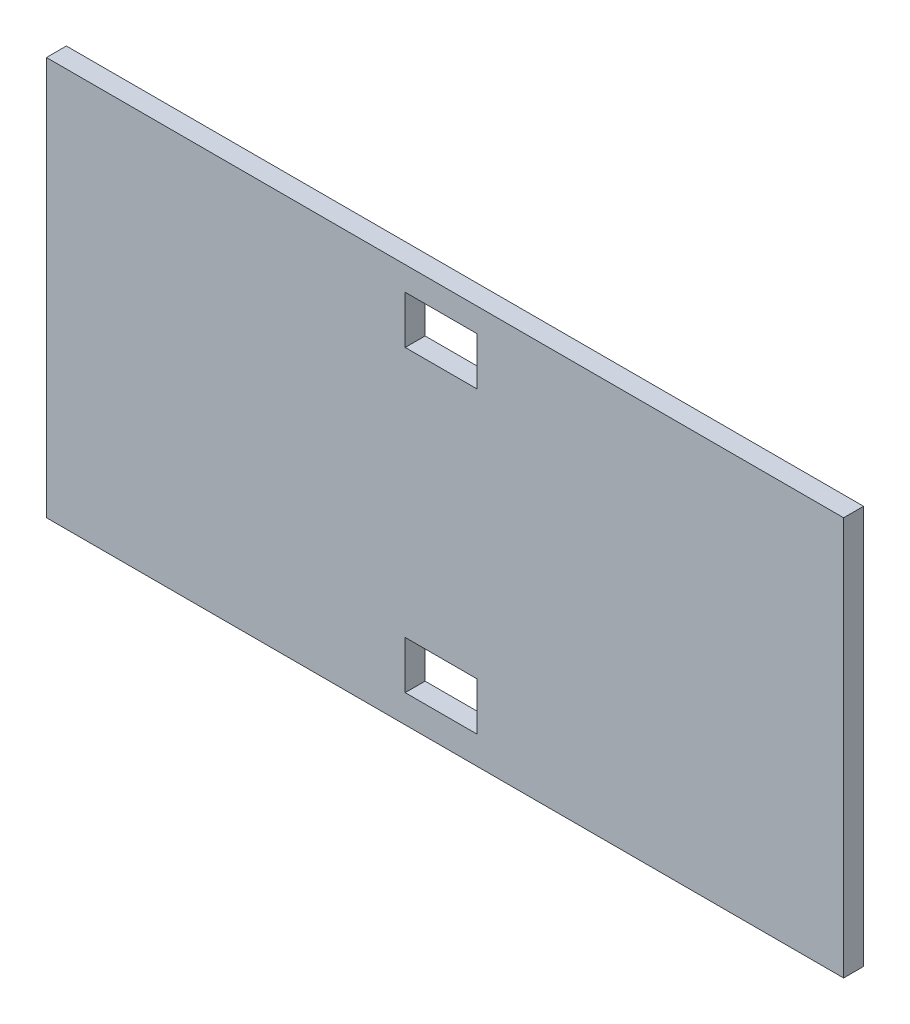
ISO-10303-21;
HEADER;
FILE_DESCRIPTION(('STEP AP214'),'2;1');
FILE_NAME('part.step','',(''),(''),'','','');
FILE_SCHEMA(('AUTOMOTIVE_DESIGN { 1 0 10303 214 1 1 1 1 }'));
ENDSEC;
DATA;
#1=APPLICATION_CONTEXT('core data for automotive mechanical design processes');
#2=APPLICATION_PROTOCOL_DEFINITION('international standard','automotive_design',2000,#1);
#3=PRODUCT_CONTEXT('',#1,'mechanical');
#4=PRODUCT('Part','Part','',(#3));
#5=PRODUCT_RELATED_PRODUCT_CATEGORY('part','',(#4));
#6=PRODUCT_DEFINITION_FORMATION('','',#4);
#7=PRODUCT_DEFINITION_CONTEXT('part definition',#1,'design');
#8=PRODUCT_DEFINITION('design','',#6,#7);
#9=PRODUCT_DEFINITION_SHAPE('','',#8);
#10=(LENGTH_UNIT() NAMED_UNIT(*) SI_UNIT(.MILLI.,.METRE.));
#11=(NAMED_UNIT(*) PLANE_ANGLE_UNIT() SI_UNIT($,.RADIAN.));
#12=(NAMED_UNIT(*) SI_UNIT($,.STERADIAN.) SOLID_ANGLE_UNIT());
#13=UNCERTAINTY_MEASURE_WITH_UNIT(LENGTH_MEASURE(1.E-05),#10,'distance_accuracy_value','');
#14=(GEOMETRIC_REPRESENTATION_CONTEXT(3) GLOBAL_UNCERTAINTY_ASSIGNED_CONTEXT((#13)) GLOBAL_UNIT_ASSIGNED_CONTEXT((#10,
#11,#12)) REPRESENTATION_CONTEXT('',''));
#15=CARTESIAN_POINT('',(0.,0.,0.));
#16=DIRECTION('',(0.,0.,1.));
#17=DIRECTION('',(1.,0.,0.));
#18=AXIS2_PLACEMENT_3D('',#15,#16,#17);
#19=CARTESIAN_POINT('',(0.,0.,6.35));
#20=DIRECTION('',(-1.,0.,0.));
#21=DIRECTION('',(0.,0.,1.));
#22=AXIS2_PLACEMENT_3D('',#19,#20,#21);
#23=PLANE('',#22);
#24=DIRECTION('',(0.,1.,0.));
#25=VECTOR('',#24,1.);
#26=CARTESIAN_POINT('',(0.,0.,0.));
#27=LINE('',#26,#25);
#28=CARTESIAN_POINT('',(0.,0.,0.));
#29=VERTEX_POINT('',#28);
#30=CARTESIAN_POINT('',(0.,127.,0.));
#31=VERTEX_POINT('',#30);
#32=EDGE_CURVE('E212',#29,#31,#27,.T.);
#33=ORIENTED_EDGE('',*,*,#32,.F.);
#34=DIRECTION('',(0.,0.,-1.));
#35=VECTOR('',#34,1.);
#36=CARTESIAN_POINT('',(0.,0.,6.35));
#37=LINE('',#36,#35);
#38=CARTESIAN_POINT('',(0.,0.,6.35));
#39=VERTEX_POINT('',#38);
#40=EDGE_CURVE('E11',#39,#29,#37,.T.);
#41=ORIENTED_EDGE('',*,*,#40,.F.);
#42=DIRECTION('',(0.,1.,0.));
#43=VECTOR('',#42,1.);
#44=CARTESIAN_POINT('',(0.,0.,6.35));
#45=LINE('',#44,#43);
#46=CARTESIAN_POINT('',(0.,127.,6.35));
#47=VERTEX_POINT('',#46);
#48=EDGE_CURVE('E222',#39,#47,#45,.T.);
#49=ORIENTED_EDGE('',*,*,#48,.T.);
#50=DIRECTION('',(0.,0.,-1.));
#51=VECTOR('',#50,1.);
#52=CARTESIAN_POINT('',(0.,127.,6.35));
#53=LINE('',#52,#51);
#54=EDGE_CURVE('E42',#47,#31,#53,.T.);
#55=ORIENTED_EDGE('',*,*,#54,.T.);
#56=EDGE_LOOP('',(#33,#41,#49,#55));
#57=FACE_BOUND('',#56,.T.);
#58=ADVANCED_FACE('F39',(#57),#23,.T.);
#59=CARTESIAN_POINT('',(0.,0.,6.35));
#60=DIRECTION('',(0.,1.,0.));
#61=DIRECTION('',(0.,0.,1.));
#62=AXIS2_PLACEMENT_3D('',#59,#60,#61);
#63=PLANE('',#62);
#64=DIRECTION('',(1.,0.,0.));
#65=VECTOR('',#64,1.);
#66=CARTESIAN_POINT('',(0.,0.,0.));
#67=LINE('',#66,#65);
#68=CARTESIAN_POINT('',(254.,0.,0.));
#69=VERTEX_POINT('',#68);
#70=EDGE_CURVE('E227',#29,#69,#67,.T.);
#71=ORIENTED_EDGE('',*,*,#70,.T.);
#72=DIRECTION('',(0.,0.,-1.));
#73=VECTOR('',#72,1.);
#74=CARTESIAN_POINT('',(254.,0.,6.35));
#75=LINE('',#74,#73);
#76=CARTESIAN_POINT('',(254.,0.,6.35));
#77=VERTEX_POINT('',#76);
#78=EDGE_CURVE('E48',#77,#69,#75,.T.);
#79=ORIENTED_EDGE('',*,*,#78,.F.);
#80=DIRECTION('',(1.,0.,0.));
#81=VECTOR('',#80,1.);
#82=CARTESIAN_POINT('',(0.,0.,6.35));
#83=LINE('',#82,#81);
#84=EDGE_CURVE('E234',#39,#77,#83,.T.);
#85=ORIENTED_EDGE('',*,*,#84,.F.);
#86=ORIENTED_EDGE('',*,*,#40,.T.);
#87=EDGE_LOOP('',(#71,#79,#85,#86));
#88=FACE_BOUND('',#87,.T.);
#89=ADVANCED_FACE('F268',(#88),#63,.F.);
#90=CARTESIAN_POINT('',(254.,0.,6.35));
#91=DIRECTION('',(-1.,0.,0.));
#92=DIRECTION('',(0.,0.,1.));
#93=AXIS2_PLACEMENT_3D('',#90,#91,#92);
#94=PLANE('',#93);
#95=DIRECTION('',(0.,1.,0.));
#96=VECTOR('',#95,1.);
#97=CARTESIAN_POINT('',(254.,0.,0.));
#98=LINE('',#97,#96);
#99=CARTESIAN_POINT('',(254.,127.,0.));
#100=VERTEX_POINT('',#99);
#101=EDGE_CURVE('E244',#69,#100,#98,.T.);
#102=ORIENTED_EDGE('',*,*,#101,.T.);
#103=DIRECTION('',(0.,0.,-1.));
#104=VECTOR('',#103,1.);
#105=CARTESIAN_POINT('',(254.,127.,6.35));
#106=LINE('',#105,#104);
#107=CARTESIAN_POINT('',(254.,127.,6.35));
#108=VERTEX_POINT('',#107);
#109=EDGE_CURVE('E252',#108,#100,#106,.T.);
#110=ORIENTED_EDGE('',*,*,#109,.F.);
#111=DIRECTION('',(0.,1.,0.));
#112=VECTOR('',#111,1.);
#113=CARTESIAN_POINT('',(254.,0.,6.35));
#114=LINE('',#113,#112);
#115=EDGE_CURVE('E231',#77,#108,#114,.T.);
#116=ORIENTED_EDGE('',*,*,#115,.F.);
#117=ORIENTED_EDGE('',*,*,#78,.T.);
#118=EDGE_LOOP('',(#102,#110,#116,#117));
#119=FACE_BOUND('',#118,.T.);
#120=ADVANCED_FACE('F272',(#119),#94,.F.);
#121=CARTESIAN_POINT('',(0.,127.,6.35));
#122=DIRECTION('',(0.,1.,0.));
#123=DIRECTION('',(0.,0.,1.));
#124=AXIS2_PLACEMENT_3D('',#121,#122,#123);
#125=PLANE('',#124);
#126=DIRECTION('',(1.,0.,0.));
#127=VECTOR('',#126,1.);
#128=CARTESIAN_POINT('',(0.,127.,0.));
#129=LINE('',#128,#127);
#130=EDGE_CURVE('E240',#31,#100,#129,.T.);
#131=ORIENTED_EDGE('',*,*,#130,.F.);
#132=ORIENTED_EDGE('',*,*,#54,.F.);
#133=DIRECTION('',(1.,0.,0.));
#134=VECTOR('',#133,1.);
#135=CARTESIAN_POINT('',(0.,127.,6.35));
#136=LINE('',#135,#134);
#137=EDGE_CURVE('E226',#47,#108,#136,.T.);
#138=ORIENTED_EDGE('',*,*,#137,.T.);
#139=ORIENTED_EDGE('',*,*,#109,.T.);
#140=EDGE_LOOP('',(#131,#132,#138,#139));
#141=FACE_BOUND('',#140,.T.);
#142=ADVANCED_FACE('F262',(#141),#125,.T.);
#143=CARTESIAN_POINT('',(0.,0.,6.35));
#144=DIRECTION('',(0.,0.,-1.));
#145=DIRECTION('',(-1.,0.,0.));
#146=AXIS2_PLACEMENT_3D('',#143,#144,#145);
#147=PLANE('',#146);
#148=DIRECTION('',(1.,0.,0.));
#149=VECTOR('',#148,1.);
#150=CARTESIAN_POINT('',(114.3,104.14,6.35));
#151=LINE('',#150,#149);
#152=CARTESIAN_POINT('',(114.3,104.14,6.35));
#153=VERTEX_POINT('',#152);
#154=CARTESIAN_POINT('',(137.16,104.14,6.35));
#155=VERTEX_POINT('',#154);
#156=EDGE_CURVE('E163',#153,#155,#151,.T.);
#157=ORIENTED_EDGE('',*,*,#156,.F.);
#158=DIRECTION('',(0.,-1.,0.));
#159=VECTOR('',#158,1.);
#160=CARTESIAN_POINT('',(114.3,119.38,6.35));
#161=LINE('',#160,#159);
#162=CARTESIAN_POINT('',(114.3,119.38,6.35));
#163=VERTEX_POINT('',#162);
#164=EDGE_CURVE('E56',#163,#153,#161,.T.);
#165=ORIENTED_EDGE('',*,*,#164,.F.);
#166=DIRECTION('',(-1.,0.,0.));
#167=VECTOR('',#166,1.);
#168=CARTESIAN_POINT('',(114.3,119.38,6.35));
#169=LINE('',#168,#167);
#170=CARTESIAN_POINT('',(137.16,119.38,6.35));
#171=VERTEX_POINT('',#170);
#172=EDGE_CURVE('E150',#171,#163,#169,.T.);
#173=ORIENTED_EDGE('',*,*,#172,.F.);
#174=DIRECTION('',(0.,1.,0.));
#175=VECTOR('',#174,1.);
#176=CARTESIAN_POINT('',(137.16,119.38,6.35));
#177=LINE('',#176,#175);
#178=EDGE_CURVE('E154',#155,#171,#177,.T.);
#179=ORIENTED_EDGE('',*,*,#178,.F.);
#180=EDGE_LOOP('',(#157,#165,#173,#179));
#181=FACE_BOUND('',#180,.T.);
#182=DIRECTION('',(1.,0.,0.));
#183=VECTOR('',#182,1.);
#184=CARTESIAN_POINT('',(114.3,8.89,6.35));
#185=LINE('',#184,#183);
#186=CARTESIAN_POINT('',(114.3,8.89,6.35));
#187=VERTEX_POINT('',#186);
#188=CARTESIAN_POINT('',(137.16,8.89,6.35));
#189=VERTEX_POINT('',#188);
#190=EDGE_CURVE('E198',#187,#189,#185,.T.);
#191=ORIENTED_EDGE('',*,*,#190,.F.);
#192=DIRECTION('',(0.,-1.,0.));
#193=VECTOR('',#192,1.);
#194=CARTESIAN_POINT('',(114.3,24.13,6.35));
#195=LINE('',#194,#193);
#196=CARTESIAN_POINT('',(114.3,24.13,6.35));
#197=VERTEX_POINT('',#196);
#198=EDGE_CURVE('E172',#197,#187,#195,.T.);
#199=ORIENTED_EDGE('',*,*,#198,.F.);
#200=DIRECTION('',(-1.,0.,0.));
#201=VECTOR('',#200,1.);
#202=CARTESIAN_POINT('',(114.3,24.13,6.35));
#203=LINE('',#202,#201);
#204=CARTESIAN_POINT('',(137.16,24.13,6.35));
#205=VERTEX_POINT('',#204);
#206=EDGE_CURVE('E183',#205,#197,#203,.T.);
#207=ORIENTED_EDGE('',*,*,#206,.F.);
#208=DIRECTION('',(0.,1.,0.));
#209=VECTOR('',#208,1.);
#210=CARTESIAN_POINT('',(137.16,24.13,6.35));
#211=LINE('',#210,#209);
#212=EDGE_CURVE('E202',#189,#205,#211,.T.);
#213=ORIENTED_EDGE('',*,*,#212,.F.);
#214=EDGE_LOOP('',(#191,#199,#207,#213));
#215=FACE_BOUND('',#214,.T.);
#216=ORIENTED_EDGE('',*,*,#48,.F.);
#217=ORIENTED_EDGE('',*,*,#84,.T.);
#218=ORIENTED_EDGE('',*,*,#115,.T.);
#219=ORIENTED_EDGE('',*,*,#137,.F.);
#220=EDGE_LOOP('',(#216,#217,#218,#219));
#221=FACE_BOUND('',#220,.T.);
#222=ADVANCED_FACE('F274',(#181,#215,#221),#147,.F.);
#223=CARTESIAN_POINT('',(0.,0.,0.));
#224=DIRECTION('',(0.,0.,-1.));
#225=DIRECTION('',(-1.,0.,0.));
#226=AXIS2_PLACEMENT_3D('',#223,#224,#225);
#227=PLANE('',#226);
#228=DIRECTION('',(0.,-1.,0.));
#229=VECTOR('',#228,1.);
#230=CARTESIAN_POINT('',(114.3,119.38,0.));
#231=LINE('',#230,#229);
#232=CARTESIAN_POINT('',(114.3,119.38,0.));
#233=VERTEX_POINT('',#232);
#234=CARTESIAN_POINT('',(114.3,104.14,0.));
#235=VERTEX_POINT('',#234);
#236=EDGE_CURVE('E131',#233,#235,#231,.T.);
#237=ORIENTED_EDGE('',*,*,#236,.T.);
#238=DIRECTION('',(1.,0.,0.));
#239=VECTOR('',#238,1.);
#240=CARTESIAN_POINT('',(114.3,104.14,0.));
#241=LINE('',#240,#239);
#242=CARTESIAN_POINT('',(137.16,104.14,0.));
#243=VERTEX_POINT('',#242);
#244=EDGE_CURVE('E141',#235,#243,#241,.T.);
#245=ORIENTED_EDGE('',*,*,#244,.T.);
#246=DIRECTION('',(0.,1.,0.));
#247=VECTOR('',#246,1.);
#248=CARTESIAN_POINT('',(137.16,119.38,0.));
#249=LINE('',#248,#247);
#250=CARTESIAN_POINT('',(137.16,119.38,0.));
#251=VERTEX_POINT('',#250);
#252=EDGE_CURVE('E64',#243,#251,#249,.T.);
#253=ORIENTED_EDGE('',*,*,#252,.T.);
#254=DIRECTION('',(-1.,0.,0.));
#255=VECTOR('',#254,1.);
#256=CARTESIAN_POINT('',(114.3,119.38,0.));
#257=LINE('',#256,#255);
#258=EDGE_CURVE('E138',#251,#233,#257,.T.);
#259=ORIENTED_EDGE('',*,*,#258,.T.);
#260=EDGE_LOOP('',(#237,#245,#253,#259));
#261=FACE_BOUND('',#260,.T.);
#262=DIRECTION('',(0.,-1.,0.));
#263=VECTOR('',#262,1.);
#264=CARTESIAN_POINT('',(114.3,24.13,0.));
#265=LINE('',#264,#263);
#266=CARTESIAN_POINT('',(114.3,24.13,0.));
#267=VERTEX_POINT('',#266);
#268=CARTESIAN_POINT('',(114.3,8.89,0.));
#269=VERTEX_POINT('',#268);
#270=EDGE_CURVE('E178',#267,#269,#265,.T.);
#271=ORIENTED_EDGE('',*,*,#270,.T.);
#272=DIRECTION('',(1.,0.,0.));
#273=VECTOR('',#272,1.);
#274=CARTESIAN_POINT('',(114.3,8.89,0.));
#275=LINE('',#274,#273);
#276=CARTESIAN_POINT('',(137.16,8.89,0.));
#277=VERTEX_POINT('',#276);
#278=EDGE_CURVE('E182',#269,#277,#275,.T.);
#279=ORIENTED_EDGE('',*,*,#278,.T.);
#280=DIRECTION('',(0.,1.,0.));
#281=VECTOR('',#280,1.);
#282=CARTESIAN_POINT('',(137.16,24.13,0.));
#283=LINE('',#282,#281);
#284=CARTESIAN_POINT('',(137.16,24.13,0.));
#285=VERTEX_POINT('',#284);
#286=EDGE_CURVE('E187',#277,#285,#283,.T.);
#287=ORIENTED_EDGE('',*,*,#286,.T.);
#288=DIRECTION('',(-1.,0.,0.));
#289=VECTOR('',#288,1.);
#290=CARTESIAN_POINT('',(114.3,24.13,0.));
#291=LINE('',#290,#289);
#292=EDGE_CURVE('E191',#285,#267,#291,.T.);
#293=ORIENTED_EDGE('',*,*,#292,.T.);
#294=EDGE_LOOP('',(#271,#279,#287,#293));
#295=FACE_BOUND('',#294,.T.);
#296=ORIENTED_EDGE('',*,*,#32,.T.);
#297=ORIENTED_EDGE('',*,*,#130,.T.);
#298=ORIENTED_EDGE('',*,*,#101,.F.);
#299=ORIENTED_EDGE('',*,*,#70,.F.);
#300=EDGE_LOOP('',(#296,#297,#298,#299));
#301=FACE_BOUND('',#300,.T.);
#302=ADVANCED_FACE('F146',(#261,#295,#301),#227,.T.);
#303=CARTESIAN_POINT('',(114.3,24.13,0.));
#304=DIRECTION('',(-1.,0.,0.));
#305=DIRECTION('',(0.,0.,1.));
#306=AXIS2_PLACEMENT_3D('',#303,#304,#305);
#307=PLANE('',#306);
#308=ORIENTED_EDGE('',*,*,#198,.T.);
#309=DIRECTION('',(0.,0.,1.));
#310=VECTOR('',#309,1.);
#311=CARTESIAN_POINT('',(114.3,8.89,0.));
#312=LINE('',#311,#310);
#313=EDGE_CURVE('E195',#269,#187,#312,.T.);
#314=ORIENTED_EDGE('',*,*,#313,.F.);
#315=ORIENTED_EDGE('',*,*,#270,.F.);
#316=DIRECTION('',(0.,0.,1.));
#317=VECTOR('',#316,1.);
#318=CARTESIAN_POINT('',(114.3,24.13,0.));
#319=LINE('',#318,#317);
#320=EDGE_CURVE('E209',#267,#197,#319,.T.);
#321=ORIENTED_EDGE('',*,*,#320,.T.);
#322=EDGE_LOOP('',(#308,#314,#315,#321));
#323=FACE_BOUND('',#322,.T.);
#324=ADVANCED_FACE('F282',(#323),#307,.F.);
#325=CARTESIAN_POINT('',(114.3,24.13,0.));
#326=DIRECTION('',(0.,1.,0.));
#327=DIRECTION('',(0.,0.,1.));
#328=AXIS2_PLACEMENT_3D('',#325,#326,#327);
#329=PLANE('',#328);
#330=ORIENTED_EDGE('',*,*,#206,.T.);
#331=ORIENTED_EDGE('',*,*,#320,.F.);
#332=ORIENTED_EDGE('',*,*,#292,.F.);
#333=DIRECTION('',(0.,0.,1.));
#334=VECTOR('',#333,1.);
#335=CARTESIAN_POINT('',(137.16,24.13,0.));
#336=LINE('',#335,#334);
#337=EDGE_CURVE('E213',#285,#205,#336,.T.);
#338=ORIENTED_EDGE('',*,*,#337,.T.);
#339=EDGE_LOOP('',(#330,#331,#332,#338));
#340=FACE_BOUND('',#339,.T.);
#341=ADVANCED_FACE('F311',(#340),#329,.F.);
#342=CARTESIAN_POINT('',(137.16,24.13,0.));
#343=DIRECTION('',(1.,0.,0.));
#344=DIRECTION('',(0.,0.,-1.));
#345=AXIS2_PLACEMENT_3D('',#342,#343,#344);
#346=PLANE('',#345);
#347=ORIENTED_EDGE('',*,*,#212,.T.);
#348=ORIENTED_EDGE('',*,*,#337,.F.);
#349=ORIENTED_EDGE('',*,*,#286,.F.);
#350=DIRECTION('',(0.,0.,1.));
#351=VECTOR('',#350,1.);
#352=CARTESIAN_POINT('',(137.16,8.89,0.));
#353=LINE('',#352,#351);
#354=EDGE_CURVE('E216',#277,#189,#353,.T.);
#355=ORIENTED_EDGE('',*,*,#354,.T.);
#356=EDGE_LOOP('',(#347,#348,#349,#355));
#357=FACE_BOUND('',#356,.T.);
#358=ADVANCED_FACE('F321',(#357),#346,.F.);
#359=CARTESIAN_POINT('',(114.3,8.89,0.));
#360=DIRECTION('',(0.,-1.,0.));
#361=DIRECTION('',(0.,0.,-1.));
#362=AXIS2_PLACEMENT_3D('',#359,#360,#361);
#363=PLANE('',#362);
#364=ORIENTED_EDGE('',*,*,#190,.T.);
#365=ORIENTED_EDGE('',*,*,#354,.F.);
#366=ORIENTED_EDGE('',*,*,#278,.F.);
#367=ORIENTED_EDGE('',*,*,#313,.T.);
#368=EDGE_LOOP('',(#364,#365,#366,#367));
#369=FACE_BOUND('',#368,.T.);
#370=ADVANCED_FACE('F331',(#369),#363,.F.);
#371=CARTESIAN_POINT('',(114.3,119.38,0.));
#372=DIRECTION('',(-1.,0.,0.));
#373=DIRECTION('',(0.,0.,1.));
#374=AXIS2_PLACEMENT_3D('',#371,#372,#373);
#375=PLANE('',#374);
#376=ORIENTED_EDGE('',*,*,#164,.T.);
#377=DIRECTION('',(0.,0.,1.));
#378=VECTOR('',#377,1.);
#379=CARTESIAN_POINT('',(114.3,104.14,0.));
#380=LINE('',#379,#378);
#381=EDGE_CURVE('E127',#235,#153,#380,.T.);
#382=ORIENTED_EDGE('',*,*,#381,.F.);
#383=ORIENTED_EDGE('',*,*,#236,.F.);
#384=DIRECTION('',(0.,0.,1.));
#385=VECTOR('',#384,1.);
#386=CARTESIAN_POINT('',(114.3,119.38,0.));
#387=LINE('',#386,#385);
#388=EDGE_CURVE('E169',#233,#163,#387,.T.);
#389=ORIENTED_EDGE('',*,*,#388,.T.);
#390=EDGE_LOOP('',(#376,#382,#383,#389));
#391=FACE_BOUND('',#390,.T.);
#392=ADVANCED_FACE('F129',(#391),#375,.F.);
#393=CARTESIAN_POINT('',(114.3,119.38,0.));
#394=DIRECTION('',(0.,1.,0.));
#395=DIRECTION('',(0.,0.,1.));
#396=AXIS2_PLACEMENT_3D('',#393,#394,#395);
#397=PLANE('',#396);
#398=ORIENTED_EDGE('',*,*,#172,.T.);
#399=ORIENTED_EDGE('',*,*,#388,.F.);
#400=ORIENTED_EDGE('',*,*,#258,.F.);
#401=DIRECTION('',(0.,0.,1.));
#402=VECTOR('',#401,1.);
#403=CARTESIAN_POINT('',(137.16,119.38,0.));
#404=LINE('',#403,#402);
#405=EDGE_CURVE('E173',#251,#171,#404,.T.);
#406=ORIENTED_EDGE('',*,*,#405,.T.);
#407=EDGE_LOOP('',(#398,#399,#400,#406));
#408=FACE_BOUND('',#407,.T.);
#409=ADVANCED_FACE('F358',(#408),#397,.F.);
#410=CARTESIAN_POINT('',(137.16,119.38,0.));
#411=DIRECTION('',(1.,0.,0.));
#412=DIRECTION('',(0.,0.,-1.));
#413=AXIS2_PLACEMENT_3D('',#410,#411,#412);
#414=PLANE('',#413);
#415=ORIENTED_EDGE('',*,*,#178,.T.);
#416=ORIENTED_EDGE('',*,*,#405,.F.);
#417=ORIENTED_EDGE('',*,*,#252,.F.);
#418=DIRECTION('',(0.,0.,1.));
#419=VECTOR('',#418,1.);
#420=CARTESIAN_POINT('',(137.16,104.14,0.));
#421=LINE('',#420,#419);
#422=EDGE_CURVE('E137',#243,#155,#421,.T.);
#423=ORIENTED_EDGE('',*,*,#422,.T.);
#424=EDGE_LOOP('',(#415,#416,#417,#423));
#425=FACE_BOUND('',#424,.T.);
#426=ADVANCED_FACE('F367',(#425),#414,.F.);
#427=CARTESIAN_POINT('',(114.3,104.14,0.));
#428=DIRECTION('',(0.,-1.,0.));
#429=DIRECTION('',(0.,0.,-1.));
#430=AXIS2_PLACEMENT_3D('',#427,#428,#429);
#431=PLANE('',#430);
#432=ORIENTED_EDGE('',*,*,#156,.T.);
#433=ORIENTED_EDGE('',*,*,#422,.F.);
#434=ORIENTED_EDGE('',*,*,#244,.F.);
#435=ORIENTED_EDGE('',*,*,#381,.T.);
#436=EDGE_LOOP('',(#432,#433,#434,#435));
#437=FACE_BOUND('',#436,.T.);
#438=ADVANCED_FACE('F142',(#437),#431,.F.);
#439=CLOSED_SHELL('',(#58,#89,#120,#142,#222,#302,#324,#341,#358,#370,#392,#409,#426,#438));
#440=MANIFOLD_SOLID_BREP('B2',#439);
#441=ADVANCED_BREP_SHAPE_REPRESENTATION('',(#18,#440),#14);
#442=SHAPE_DEFINITION_REPRESENTATION(#9,#441);
ENDSEC;
END-ISO-10303-21;
